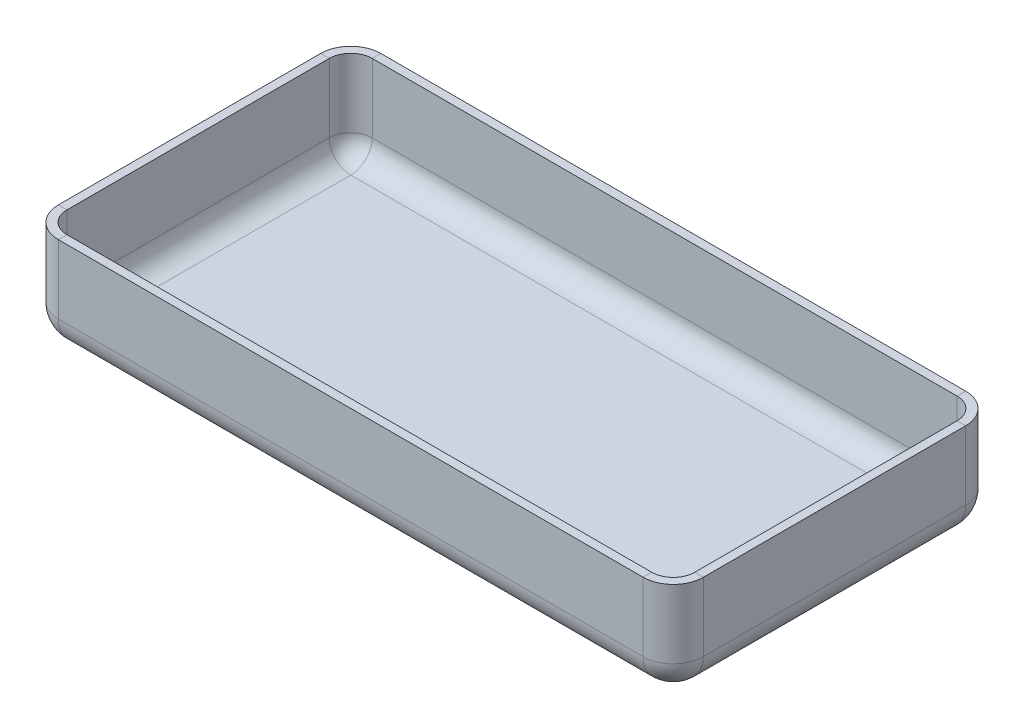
ISO-10303-21;
HEADER;
FILE_DESCRIPTION(('STEP AP214'),'2;1');
FILE_NAME('part.step','',(''),(''),'','','');
FILE_SCHEMA(('AUTOMOTIVE_DESIGN { 1 0 10303 214 1 1 1 1 }'));
ENDSEC;
DATA;
#1=APPLICATION_CONTEXT('core data for automotive mechanical design processes');
#2=APPLICATION_PROTOCOL_DEFINITION('international standard','automotive_design',2000,#1);
#3=PRODUCT_CONTEXT('',#1,'mechanical');
#4=PRODUCT('Part','Part','',(#3));
#5=PRODUCT_RELATED_PRODUCT_CATEGORY('part','',(#4));
#6=PRODUCT_DEFINITION_FORMATION('','',#4);
#7=PRODUCT_DEFINITION_CONTEXT('part definition',#1,'design');
#8=PRODUCT_DEFINITION('design','',#6,#7);
#9=PRODUCT_DEFINITION_SHAPE('','',#8);
#10=(LENGTH_UNIT() NAMED_UNIT(*) SI_UNIT(.MILLI.,.METRE.));
#11=(NAMED_UNIT(*) PLANE_ANGLE_UNIT() SI_UNIT($,.RADIAN.));
#12=(NAMED_UNIT(*) SI_UNIT($,.STERADIAN.) SOLID_ANGLE_UNIT());
#13=UNCERTAINTY_MEASURE_WITH_UNIT(LENGTH_MEASURE(1.E-05),#10,'distance_accuracy_value','');
#14=(GEOMETRIC_REPRESENTATION_CONTEXT(3) GLOBAL_UNCERTAINTY_ASSIGNED_CONTEXT((#13)) GLOBAL_UNIT_ASSIGNED_CONTEXT((#10,
#11,#12)) REPRESENTATION_CONTEXT('',''));
#15=CARTESIAN_POINT('',(0.,0.,0.));
#16=DIRECTION('',(0.,0.,1.));
#17=DIRECTION('',(1.,0.,0.));
#18=AXIS2_PLACEMENT_3D('',#15,#16,#17);
#19=CARTESIAN_POINT('',(0.,30.,0.));
#20=DIRECTION('',(1.,0.,0.));
#21=DIRECTION('',(0.,0.,-1.));
#22=AXIS2_PLACEMENT_3D('',#19,#20,#21);
#23=PLANE('',#22);
#24=DIRECTION('',(0.,-1.,0.));
#25=VECTOR('',#24,1.);
#26=CARTESIAN_POINT('',(0.,30.,-7.));
#27=LINE('',#26,#25);
#28=CARTESIAN_POINT('',(0.,7.,-7.));
#29=VERTEX_POINT('',#28);
#30=CARTESIAN_POINT('',(0.,23.,-7.));
#31=VERTEX_POINT('',#30);
#32=EDGE_CURVE('E226',#29,#31,#27,.F.);
#33=ORIENTED_EDGE('',*,*,#32,.T.);
#34=DIRECTION('',(0.,0.,1.));
#35=VECTOR('',#34,1.);
#36=CARTESIAN_POINT('',(0.,23.,0.));
#37=LINE('',#36,#35);
#38=CARTESIAN_POINT('',(0.,23.,-68.));
#39=VERTEX_POINT('',#38);
#40=EDGE_CURVE('E229',#31,#39,#37,.F.);
#41=ORIENTED_EDGE('',*,*,#40,.T.);
#42=DIRECTION('',(0.,-1.,0.));
#43=VECTOR('',#42,1.);
#44=CARTESIAN_POINT('',(0.,30.,-68.));
#45=LINE('',#44,#43);
#46=CARTESIAN_POINT('',(0.,7.,-68.));
#47=VERTEX_POINT('',#46);
#48=EDGE_CURVE('E224',#39,#47,#45,.T.);
#49=ORIENTED_EDGE('',*,*,#48,.T.);
#50=DIRECTION('',(0.,0.,1.));
#51=VECTOR('',#50,1.);
#52=CARTESIAN_POINT('',(0.,7.,0.));
#53=LINE('',#52,#51);
#54=EDGE_CURVE('E222',#47,#29,#53,.T.);
#55=ORIENTED_EDGE('',*,*,#54,.T.);
#56=EDGE_LOOP('',(#33,#41,#49,#55));
#57=FACE_BOUND('',#56,.T.);
#58=ADVANCED_FACE('F33',(#57),#23,.F.);
#59=CARTESIAN_POINT('',(0.,30.,0.));
#60=DIRECTION('',(0.,0.,-1.));
#61=DIRECTION('',(-1.,0.,0.));
#62=AXIS2_PLACEMENT_3D('',#59,#60,#61);
#63=PLANE('',#62);
#64=DIRECTION('',(0.,-1.,0.));
#65=VECTOR('',#64,1.);
#66=CARTESIAN_POINT('',(143.,30.,0.));
#67=LINE('',#66,#65);
#68=CARTESIAN_POINT('',(143.,7.,0.));
#69=VERTEX_POINT('',#68);
#70=CARTESIAN_POINT('',(143.,23.,0.));
#71=VERTEX_POINT('',#70);
#72=EDGE_CURVE('E208',#69,#71,#67,.F.);
#73=ORIENTED_EDGE('',*,*,#72,.T.);
#74=DIRECTION('',(1.,0.,0.));
#75=VECTOR('',#74,1.);
#76=CARTESIAN_POINT('',(0.,23.,0.));
#77=LINE('',#76,#75);
#78=CARTESIAN_POINT('',(7.,23.,0.));
#79=VERTEX_POINT('',#78);
#80=EDGE_CURVE('E219',#71,#79,#77,.F.);
#81=ORIENTED_EDGE('',*,*,#80,.T.);
#82=DIRECTION('',(0.,-1.,0.));
#83=VECTOR('',#82,1.);
#84=CARTESIAN_POINT('',(7.,30.,0.));
#85=LINE('',#84,#83);
#86=CARTESIAN_POINT('',(7.,7.,0.));
#87=VERTEX_POINT('',#86);
#88=EDGE_CURVE('E216',#79,#87,#85,.T.);
#89=ORIENTED_EDGE('',*,*,#88,.T.);
#90=DIRECTION('',(1.,0.,0.));
#91=VECTOR('',#90,1.);
#92=CARTESIAN_POINT('',(150.,7.,0.));
#93=LINE('',#92,#91);
#94=EDGE_CURVE('E205',#87,#69,#93,.T.);
#95=ORIENTED_EDGE('',*,*,#94,.T.);
#96=EDGE_LOOP('',(#73,#81,#89,#95));
#97=FACE_BOUND('',#96,.T.);
#98=ADVANCED_FACE('F333',(#97),#63,.F.);
#99=CARTESIAN_POINT('',(150.,30.,0.));
#100=DIRECTION('',(-1.,0.,0.));
#101=DIRECTION('',(0.,0.,1.));
#102=AXIS2_PLACEMENT_3D('',#99,#100,#101);
#103=PLANE('',#102);
#104=DIRECTION('',(0.,-1.,0.));
#105=VECTOR('',#104,1.);
#106=CARTESIAN_POINT('',(150.,30.,-68.));
#107=LINE('',#106,#105);
#108=CARTESIAN_POINT('',(150.,7.,-68.));
#109=VERTEX_POINT('',#108);
#110=CARTESIAN_POINT('',(150.,23.,-68.));
#111=VERTEX_POINT('',#110);
#112=EDGE_CURVE('E193',#109,#111,#107,.F.);
#113=ORIENTED_EDGE('',*,*,#112,.T.);
#114=DIRECTION('',(0.,0.,-1.));
#115=VECTOR('',#114,1.);
#116=CARTESIAN_POINT('',(150.,23.,0.));
#117=LINE('',#116,#115);
#118=CARTESIAN_POINT('',(150.,23.,-7.));
#119=VERTEX_POINT('',#118);
#120=EDGE_CURVE('E167',#111,#119,#117,.F.);
#121=ORIENTED_EDGE('',*,*,#120,.T.);
#122=DIRECTION('',(0.,-1.,0.));
#123=VECTOR('',#122,1.);
#124=CARTESIAN_POINT('',(150.,30.,-7.));
#125=LINE('',#124,#123);
#126=CARTESIAN_POINT('',(150.,7.,-7.));
#127=VERTEX_POINT('',#126);
#128=EDGE_CURVE('E179',#119,#127,#125,.T.);
#129=ORIENTED_EDGE('',*,*,#128,.T.);
#130=DIRECTION('',(0.,0.,-1.));
#131=VECTOR('',#130,1.);
#132=CARTESIAN_POINT('',(150.,7.,-75.));
#133=LINE('',#132,#131);
#134=EDGE_CURVE('E196',#127,#109,#133,.T.);
#135=ORIENTED_EDGE('',*,*,#134,.T.);
#136=EDGE_LOOP('',(#113,#121,#129,#135));
#137=FACE_BOUND('',#136,.T.);
#138=ADVANCED_FACE('F194',(#137),#103,.F.);
#139=CARTESIAN_POINT('',(0.,30.,-75.));
#140=DIRECTION('',(0.,0.,1.));
#141=DIRECTION('',(1.,0.,0.));
#142=AXIS2_PLACEMENT_3D('',#139,#140,#141);
#143=PLANE('',#142);
#144=DIRECTION('',(0.,-1.,0.));
#145=VECTOR('',#144,1.);
#146=CARTESIAN_POINT('',(7.,30.,-75.));
#147=LINE('',#146,#145);
#148=CARTESIAN_POINT('',(7.,7.,-75.));
#149=VERTEX_POINT('',#148);
#150=CARTESIAN_POINT('',(7.,23.,-75.));
#151=VERTEX_POINT('',#150);
#152=EDGE_CURVE('E235',#149,#151,#147,.F.);
#153=ORIENTED_EDGE('',*,*,#152,.T.);
#154=DIRECTION('',(-1.,0.,0.));
#155=VECTOR('',#154,1.);
#156=CARTESIAN_POINT('',(0.,23.,-75.));
#157=LINE('',#156,#155);
#158=CARTESIAN_POINT('',(143.,23.,-75.));
#159=VERTEX_POINT('',#158);
#160=EDGE_CURVE('E239',#151,#159,#157,.F.);
#161=ORIENTED_EDGE('',*,*,#160,.T.);
#162=DIRECTION('',(0.,-1.,0.));
#163=VECTOR('',#162,1.);
#164=CARTESIAN_POINT('',(143.,30.,-75.));
#165=LINE('',#164,#163);
#166=CARTESIAN_POINT('',(143.,7.,-75.));
#167=VERTEX_POINT('',#166);
#168=EDGE_CURVE('E204',#159,#167,#165,.T.);
#169=ORIENTED_EDGE('',*,*,#168,.T.);
#170=DIRECTION('',(-1.,0.,0.));
#171=VECTOR('',#170,1.);
#172=CARTESIAN_POINT('',(0.,7.,-75.));
#173=LINE('',#172,#171);
#174=EDGE_CURVE('E178',#167,#149,#173,.T.);
#175=ORIENTED_EDGE('',*,*,#174,.T.);
#176=EDGE_LOOP('',(#153,#161,#169,#175));
#177=FACE_BOUND('',#176,.T.);
#178=ADVANCED_FACE('F294',(#177),#143,.F.);
#179=CARTESIAN_POINT('',(0.,0.,-75.));
#180=DIRECTION('',(0.,-1.,0.));
#181=DIRECTION('',(0.,0.,-1.));
#182=AXIS2_PLACEMENT_3D('',#179,#180,#181);
#183=PLANE('',#182);
#184=DIRECTION('',(0.,0.,-1.));
#185=VECTOR('',#184,1.);
#186=CARTESIAN_POINT('',(143.,0.,0.));
#187=LINE('',#186,#185);
#188=CARTESIAN_POINT('',(143.,0.,-68.));
#189=VERTEX_POINT('',#188);
#190=CARTESIAN_POINT('',(143.,0.,-7.));
#191=VERTEX_POINT('',#190);
#192=EDGE_CURVE('E40',#189,#191,#187,.F.);
#193=ORIENTED_EDGE('',*,*,#192,.T.);
#194=DIRECTION('',(1.,0.,0.));
#195=VECTOR('',#194,1.);
#196=CARTESIAN_POINT('',(0.,0.,-7.));
#197=LINE('',#196,#195);
#198=CARTESIAN_POINT('',(7.,0.,-7.));
#199=VERTEX_POINT('',#198);
#200=EDGE_CURVE('E11',#191,#199,#197,.F.);
#201=ORIENTED_EDGE('',*,*,#200,.T.);
#202=DIRECTION('',(0.,0.,1.));
#203=VECTOR('',#202,1.);
#204=CARTESIAN_POINT('',(7.,0.,-75.));
#205=LINE('',#204,#203);
#206=CARTESIAN_POINT('',(7.,0.,-68.));
#207=VERTEX_POINT('',#206);
#208=EDGE_CURVE('E242',#199,#207,#205,.F.);
#209=ORIENTED_EDGE('',*,*,#208,.T.);
#210=DIRECTION('',(-1.,0.,0.));
#211=VECTOR('',#210,1.);
#212=CARTESIAN_POINT('',(150.,0.,-68.));
#213=LINE('',#212,#211);
#214=EDGE_CURVE('E50',#207,#189,#213,.F.);
#215=ORIENTED_EDGE('',*,*,#214,.T.);
#216=EDGE_LOOP('',(#193,#201,#209,#215));
#217=FACE_BOUND('',#216,.T.);
#218=ADVANCED_FACE('F245',(#217),#183,.T.);
#219=CARTESIAN_POINT('',(143.,30.,-68.));
#220=DIRECTION('',(0.,-1.,0.));
#221=DIRECTION('',(0.,0.,-1.));
#222=AXIS2_PLACEMENT_3D('',#219,#220,#221);
#223=CYLINDRICAL_SURFACE('',#222,7.);
#224=CARTESIAN_POINT('',(143.,23.,-68.));
#225=DIRECTION('',(0.,1.,0.));
#226=DIRECTION('',(0.,0.,1.));
#227=AXIS2_PLACEMENT_3D('',#224,#225,#226);
#228=CIRCLE('',#227,7.);
#229=EDGE_CURVE('E185',#111,#159,#228,.T.);
#230=ORIENTED_EDGE('',*,*,#229,.F.);
#231=ORIENTED_EDGE('',*,*,#112,.F.);
#232=CARTESIAN_POINT('',(143.,7.,-68.));
#233=DIRECTION('',(0.,-1.,0.));
#234=DIRECTION('',(0.,0.,-1.));
#235=AXIS2_PLACEMENT_3D('',#232,#233,#234);
#236=CIRCLE('',#235,7.);
#237=EDGE_CURVE('E206',#167,#109,#236,.T.);
#238=ORIENTED_EDGE('',*,*,#237,.F.);
#239=ORIENTED_EDGE('',*,*,#168,.F.);
#240=EDGE_LOOP('',(#230,#231,#238,#239));
#241=FACE_BOUND('',#240,.T.);
#242=ADVANCED_FACE('F202',(#241),#223,.T.);
#243=CARTESIAN_POINT('',(143.,7.,-68.));
#244=DIRECTION('',(0.,0.,1.));
#245=DIRECTION('',(1.,0.,0.));
#246=AXIS2_PLACEMENT_3D('',#243,#244,#245);
#247=SPHERICAL_SURFACE('',#246,7.);
#248=CARTESIAN_POINT('',(143.,7.,-68.));
#249=DIRECTION('',(1.,0.,0.));
#250=DIRECTION('',(0.,0.,-1.));
#251=AXIS2_PLACEMENT_3D('',#248,#249,#250);
#252=CIRCLE('',#251,7.);
#253=EDGE_CURVE('E257',#167,#189,#252,.F.);
#254=ORIENTED_EDGE('',*,*,#253,.F.);
#255=ORIENTED_EDGE('',*,*,#237,.T.);
#256=CARTESIAN_POINT('',(143.,7.,-68.));
#257=DIRECTION('',(0.,0.,-1.));
#258=DIRECTION('',(-1.,0.,0.));
#259=AXIS2_PLACEMENT_3D('',#256,#257,#258);
#260=CIRCLE('',#259,7.);
#261=EDGE_CURVE('E210',#189,#109,#260,.F.);
#262=ORIENTED_EDGE('',*,*,#261,.F.);
#263=EDGE_LOOP('',(#254,#255,#262));
#264=FACE_BOUND('',#263,.T.);
#265=ADVANCED_FACE('F292',(#264),#247,.T.);
#266=CARTESIAN_POINT('',(143.,30.,-7.));
#267=DIRECTION('',(0.,-1.,0.));
#268=DIRECTION('',(0.,0.,-1.));
#269=AXIS2_PLACEMENT_3D('',#266,#267,#268);
#270=CYLINDRICAL_SURFACE('',#269,7.);
#271=CARTESIAN_POINT('',(143.,7.,-7.));
#272=DIRECTION('',(0.,-1.,0.));
#273=DIRECTION('',(0.,0.,-1.));
#274=AXIS2_PLACEMENT_3D('',#271,#272,#273);
#275=CIRCLE('',#274,7.);
#276=EDGE_CURVE('E281',#127,#69,#275,.T.);
#277=ORIENTED_EDGE('',*,*,#276,.F.);
#278=ORIENTED_EDGE('',*,*,#128,.F.);
#279=CARTESIAN_POINT('',(143.,23.,-7.));
#280=DIRECTION('',(0.,1.,0.));
#281=DIRECTION('',(0.,0.,1.));
#282=AXIS2_PLACEMENT_3D('',#279,#280,#281);
#283=CIRCLE('',#282,7.);
#284=EDGE_CURVE('E284',#71,#119,#283,.T.);
#285=ORIENTED_EDGE('',*,*,#284,.F.);
#286=ORIENTED_EDGE('',*,*,#72,.F.);
#287=EDGE_LOOP('',(#277,#278,#285,#286));
#288=FACE_BOUND('',#287,.T.);
#289=ADVANCED_FACE('F368',(#288),#270,.T.);
#290=CARTESIAN_POINT('',(143.,7.,0.));
#291=DIRECTION('',(0.,0.,1.));
#292=DIRECTION('',(1.,0.,0.));
#293=AXIS2_PLACEMENT_3D('',#290,#291,#292);
#294=CYLINDRICAL_SURFACE('',#293,7.);
#295=ORIENTED_EDGE('',*,*,#261,.T.);
#296=ORIENTED_EDGE('',*,*,#134,.F.);
#297=CARTESIAN_POINT('',(143.,7.,-7.));
#298=DIRECTION('',(0.,0.,1.));
#299=DIRECTION('',(1.,0.,0.));
#300=AXIS2_PLACEMENT_3D('',#297,#298,#299);
#301=CIRCLE('',#300,7.);
#302=EDGE_CURVE('E266',#191,#127,#301,.T.);
#303=ORIENTED_EDGE('',*,*,#302,.F.);
#304=ORIENTED_EDGE('',*,*,#192,.F.);
#305=EDGE_LOOP('',(#295,#296,#303,#304));
#306=FACE_BOUND('',#305,.T.);
#307=ADVANCED_FACE('F290',(#306),#294,.T.);
#308=CARTESIAN_POINT('',(0.,7.,-68.));
#309=DIRECTION('',(1.,0.,0.));
#310=DIRECTION('',(0.,0.,-1.));
#311=AXIS2_PLACEMENT_3D('',#308,#309,#310);
#312=CYLINDRICAL_SURFACE('',#311,7.);
#313=ORIENTED_EDGE('',*,*,#253,.T.);
#314=ORIENTED_EDGE('',*,*,#214,.F.);
#315=CARTESIAN_POINT('',(7.,7.,-68.));
#316=DIRECTION('',(-1.,0.,0.));
#317=DIRECTION('',(0.,0.,1.));
#318=AXIS2_PLACEMENT_3D('',#315,#316,#317);
#319=CIRCLE('',#318,7.);
#320=EDGE_CURVE('E254',#149,#207,#319,.T.);
#321=ORIENTED_EDGE('',*,*,#320,.F.);
#322=ORIENTED_EDGE('',*,*,#174,.F.);
#323=EDGE_LOOP('',(#313,#314,#321,#322));
#324=FACE_BOUND('',#323,.T.);
#325=ADVANCED_FACE('F253',(#324),#312,.T.);
#326=CARTESIAN_POINT('',(7.,30.,-68.));
#327=DIRECTION('',(0.,-1.,0.));
#328=DIRECTION('',(0.,0.,-1.));
#329=AXIS2_PLACEMENT_3D('',#326,#327,#328);
#330=CYLINDRICAL_SURFACE('',#329,7.);
#331=CARTESIAN_POINT('',(7.,23.,-68.));
#332=DIRECTION('',(0.,1.,0.));
#333=DIRECTION('',(0.,0.,1.));
#334=AXIS2_PLACEMENT_3D('',#331,#332,#333);
#335=CIRCLE('',#334,7.);
#336=EDGE_CURVE('E286',#151,#39,#335,.T.);
#337=ORIENTED_EDGE('',*,*,#336,.F.);
#338=ORIENTED_EDGE('',*,*,#152,.F.);
#339=CARTESIAN_POINT('',(7.,7.,-68.));
#340=DIRECTION('',(0.,-1.,0.));
#341=DIRECTION('',(0.,0.,-1.));
#342=AXIS2_PLACEMENT_3D('',#339,#340,#341);
#343=CIRCLE('',#342,7.);
#344=EDGE_CURVE('E265',#47,#149,#343,.T.);
#345=ORIENTED_EDGE('',*,*,#344,.F.);
#346=ORIENTED_EDGE('',*,*,#48,.F.);
#347=EDGE_LOOP('',(#337,#338,#345,#346));
#348=FACE_BOUND('',#347,.T.);
#349=ADVANCED_FACE('F340',(#348),#330,.T.);
#350=CARTESIAN_POINT('',(143.,7.,-7.));
#351=DIRECTION('',(0.,0.,1.));
#352=DIRECTION('',(1.,0.,0.));
#353=AXIS2_PLACEMENT_3D('',#350,#351,#352);
#354=SPHERICAL_SURFACE('',#353,7.);
#355=ORIENTED_EDGE('',*,*,#302,.T.);
#356=ORIENTED_EDGE('',*,*,#276,.T.);
#357=CARTESIAN_POINT('',(143.,7.,-7.));
#358=DIRECTION('',(1.,0.,0.));
#359=DIRECTION('',(0.,0.,-1.));
#360=AXIS2_PLACEMENT_3D('',#357,#358,#359);
#361=CIRCLE('',#360,7.);
#362=EDGE_CURVE('E269',#191,#69,#361,.F.);
#363=ORIENTED_EDGE('',*,*,#362,.F.);
#364=EDGE_LOOP('',(#355,#356,#363));
#365=FACE_BOUND('',#364,.T.);
#366=ADVANCED_FACE('F342',(#365),#354,.T.);
#367=CARTESIAN_POINT('',(7.,7.,-68.));
#368=DIRECTION('',(0.,0.,1.));
#369=DIRECTION('',(1.,0.,0.));
#370=AXIS2_PLACEMENT_3D('',#367,#368,#369);
#371=SPHERICAL_SURFACE('',#370,7.);
#372=ORIENTED_EDGE('',*,*,#344,.T.);
#373=ORIENTED_EDGE('',*,*,#320,.T.);
#374=CARTESIAN_POINT('',(7.,7.,-68.));
#375=DIRECTION('',(0.,0.,-1.));
#376=DIRECTION('',(-1.,0.,0.));
#377=AXIS2_PLACEMENT_3D('',#374,#375,#376);
#378=CIRCLE('',#377,7.);
#379=EDGE_CURVE('E262',#47,#207,#378,.F.);
#380=ORIENTED_EDGE('',*,*,#379,.F.);
#381=EDGE_LOOP('',(#372,#373,#380));
#382=FACE_BOUND('',#381,.T.);
#383=ADVANCED_FACE('F261',(#382),#371,.T.);
#384=CARTESIAN_POINT('',(0.,7.,-7.));
#385=DIRECTION('',(-1.,0.,0.));
#386=DIRECTION('',(0.,0.,1.));
#387=AXIS2_PLACEMENT_3D('',#384,#385,#386);
#388=CYLINDRICAL_SURFACE('',#387,7.);
#389=ORIENTED_EDGE('',*,*,#362,.T.);
#390=ORIENTED_EDGE('',*,*,#94,.F.);
#391=CARTESIAN_POINT('',(7.,7.,-7.));
#392=DIRECTION('',(-1.,0.,0.));
#393=DIRECTION('',(0.,0.,1.));
#394=AXIS2_PLACEMENT_3D('',#391,#392,#393);
#395=CIRCLE('',#394,7.);
#396=EDGE_CURVE('E270',#199,#87,#395,.T.);
#397=ORIENTED_EDGE('',*,*,#396,.F.);
#398=ORIENTED_EDGE('',*,*,#200,.F.);
#399=EDGE_LOOP('',(#389,#390,#397,#398));
#400=FACE_BOUND('',#399,.T.);
#401=ADVANCED_FACE('F328',(#400),#388,.T.);
#402=CARTESIAN_POINT('',(7.,7.,0.));
#403=DIRECTION('',(0.,0.,-1.));
#404=DIRECTION('',(-1.,0.,0.));
#405=AXIS2_PLACEMENT_3D('',#402,#403,#404);
#406=CYLINDRICAL_SURFACE('',#405,7.);
#407=ORIENTED_EDGE('',*,*,#379,.T.);
#408=ORIENTED_EDGE('',*,*,#208,.F.);
#409=CARTESIAN_POINT('',(7.,7.,-7.));
#410=DIRECTION('',(0.,0.,1.));
#411=DIRECTION('',(1.,0.,0.));
#412=AXIS2_PLACEMENT_3D('',#409,#410,#411);
#413=CIRCLE('',#412,7.);
#414=EDGE_CURVE('E275',#29,#199,#413,.T.);
#415=ORIENTED_EDGE('',*,*,#414,.F.);
#416=ORIENTED_EDGE('',*,*,#54,.F.);
#417=EDGE_LOOP('',(#407,#408,#415,#416));
#418=FACE_BOUND('',#417,.T.);
#419=ADVANCED_FACE('F268',(#418),#406,.T.);
#420=CARTESIAN_POINT('',(7.,7.,-7.));
#421=DIRECTION('',(0.,0.,1.));
#422=DIRECTION('',(1.,0.,0.));
#423=AXIS2_PLACEMENT_3D('',#420,#421,#422);
#424=SPHERICAL_SURFACE('',#423,7.);
#425=ORIENTED_EDGE('',*,*,#414,.T.);
#426=ORIENTED_EDGE('',*,*,#396,.T.);
#427=CARTESIAN_POINT('',(7.,7.,-7.));
#428=DIRECTION('',(0.,-1.,0.));
#429=DIRECTION('',(0.,0.,-1.));
#430=AXIS2_PLACEMENT_3D('',#427,#428,#429);
#431=CIRCLE('',#430,7.);
#432=EDGE_CURVE('E316',#29,#87,#431,.F.);
#433=ORIENTED_EDGE('',*,*,#432,.F.);
#434=EDGE_LOOP('',(#425,#426,#433));
#435=FACE_BOUND('',#434,.T.);
#436=ADVANCED_FACE('F324',(#435),#424,.T.);
#437=CARTESIAN_POINT('',(7.,30.,-7.));
#438=DIRECTION('',(0.,-1.,0.));
#439=DIRECTION('',(0.,0.,-1.));
#440=AXIS2_PLACEMENT_3D('',#437,#438,#439);
#441=CYLINDRICAL_SURFACE('',#440,7.);
#442=CARTESIAN_POINT('',(7.,23.,-7.));
#443=DIRECTION('',(0.,1.,0.));
#444=DIRECTION('',(0.,0.,1.));
#445=AXIS2_PLACEMENT_3D('',#442,#443,#444);
#446=CIRCLE('',#445,7.);
#447=EDGE_CURVE('E318',#79,#31,#446,.F.);
#448=ORIENTED_EDGE('',*,*,#447,.T.);
#449=ORIENTED_EDGE('',*,*,#32,.F.);
#450=ORIENTED_EDGE('',*,*,#432,.T.);
#451=ORIENTED_EDGE('',*,*,#88,.F.);
#452=EDGE_LOOP('',(#448,#449,#450,#451));
#453=FACE_BOUND('',#452,.T.);
#454=ADVANCED_FACE('F335',(#453),#441,.T.);
#455=CARTESIAN_POINT('',(7.,23.,-7.));
#456=DIRECTION('',(0.,-1.,0.));
#457=DIRECTION('',(0.,0.,-1.));
#458=AXIS2_PLACEMENT_3D('',#455,#456,#457);
#459=PLANE('',#458);
#460=ORIENTED_EDGE('',*,*,#447,.F.);
#461=DIRECTION('',(0.,0.,1.));
#462=VECTOR('',#461,1.);
#463=CARTESIAN_POINT('',(7.,23.,0.));
#464=LINE('',#463,#462);
#465=CARTESIAN_POINT('',(7.,23.,-2.));
#466=VERTEX_POINT('',#465);
#467=EDGE_CURVE('E724',#466,#79,#464,.T.);
#468=ORIENTED_EDGE('',*,*,#467,.F.);
#469=CARTESIAN_POINT('',(7.,23.,-7.));
#470=DIRECTION('',(0.,-1.,0.));
#471=DIRECTION('',(0.,0.,-1.));
#472=AXIS2_PLACEMENT_3D('',#469,#470,#471);
#473=CIRCLE('',#472,5.);
#474=CARTESIAN_POINT('',(2.,23.,-7.));
#475=VERTEX_POINT('',#474);
#476=EDGE_CURVE('E190',#466,#475,#473,.T.);
#477=ORIENTED_EDGE('',*,*,#476,.T.);
#478=DIRECTION('',(1.,0.,0.));
#479=VECTOR('',#478,1.);
#480=CARTESIAN_POINT('',(0.,23.,-7.));
#481=LINE('',#480,#479);
#482=EDGE_CURVE('E319',#475,#31,#481,.F.);
#483=ORIENTED_EDGE('',*,*,#482,.T.);
#484=EDGE_LOOP('',(#460,#468,#477,#483));
#485=FACE_BOUND('',#484,.T.);
#486=ADVANCED_FACE('F465',(#485),#459,.F.);
#487=CARTESIAN_POINT('',(75.,23.,0.));
#488=DIRECTION('',(0.,-1.,0.));
#489=DIRECTION('',(1.,0.,0.));
#490=AXIS2_PLACEMENT_3D('',#487,#488,#489);
#491=PLANE('',#490);
#492=ORIENTED_EDGE('',*,*,#80,.F.);
#493=DIRECTION('',(0.,0.,-1.));
#494=VECTOR('',#493,1.);
#495=CARTESIAN_POINT('',(143.,23.,0.));
#496=LINE('',#495,#494);
#497=CARTESIAN_POINT('',(143.,23.,-2.));
#498=VERTEX_POINT('',#497);
#499=EDGE_CURVE('E309',#498,#71,#496,.F.);
#500=ORIENTED_EDGE('',*,*,#499,.F.);
#501=DIRECTION('',(-1.,0.,0.));
#502=VECTOR('',#501,1.);
#503=CARTESIAN_POINT('',(0.,23.,-2.));
#504=LINE('',#503,#502);
#505=EDGE_CURVE('E720',#498,#466,#504,.T.);
#506=ORIENTED_EDGE('',*,*,#505,.T.);
#507=ORIENTED_EDGE('',*,*,#467,.T.);
#508=EDGE_LOOP('',(#492,#500,#506,#507));
#509=FACE_BOUND('',#508,.T.);
#510=ADVANCED_FACE('F475',(#509),#491,.F.);
#511=CARTESIAN_POINT('',(0.,23.,-37.5));
#512=DIRECTION('',(0.,-1.,0.));
#513=DIRECTION('',(0.,0.,1.));
#514=AXIS2_PLACEMENT_3D('',#511,#512,#513);
#515=PLANE('',#514);
#516=ORIENTED_EDGE('',*,*,#40,.F.);
#517=ORIENTED_EDGE('',*,*,#482,.F.);
#518=DIRECTION('',(0.,0.,-1.));
#519=VECTOR('',#518,1.);
#520=CARTESIAN_POINT('',(2.,23.,0.));
#521=LINE('',#520,#519);
#522=CARTESIAN_POINT('',(2.,23.,-68.));
#523=VERTEX_POINT('',#522);
#524=EDGE_CURVE('E727',#475,#523,#521,.T.);
#525=ORIENTED_EDGE('',*,*,#524,.T.);
#526=DIRECTION('',(-1.,0.,0.));
#527=VECTOR('',#526,1.);
#528=CARTESIAN_POINT('',(0.,23.,-68.));
#529=LINE('',#528,#527);
#530=EDGE_CURVE('E312',#523,#39,#529,.T.);
#531=ORIENTED_EDGE('',*,*,#530,.T.);
#532=EDGE_LOOP('',(#516,#517,#525,#531));
#533=FACE_BOUND('',#532,.T.);
#534=ADVANCED_FACE('F486',(#533),#515,.F.);
#535=CARTESIAN_POINT('',(143.,23.,-7.));
#536=DIRECTION('',(0.,-1.,0.));
#537=DIRECTION('',(0.,0.,-1.));
#538=AXIS2_PLACEMENT_3D('',#535,#536,#537);
#539=PLANE('',#538);
#540=ORIENTED_EDGE('',*,*,#284,.T.);
#541=DIRECTION('',(1.,0.,0.));
#542=VECTOR('',#541,1.);
#543=CARTESIAN_POINT('',(150.,23.,-7.));
#544=LINE('',#543,#542);
#545=CARTESIAN_POINT('',(148.,23.,-7.));
#546=VERTEX_POINT('',#545);
#547=EDGE_CURVE('E173',#546,#119,#544,.T.);
#548=ORIENTED_EDGE('',*,*,#547,.F.);
#549=CARTESIAN_POINT('',(143.,23.,-7.));
#550=DIRECTION('',(0.,-1.,0.));
#551=DIRECTION('',(0.,0.,-1.));
#552=AXIS2_PLACEMENT_3D('',#549,#550,#551);
#553=CIRCLE('',#552,5.);
#554=EDGE_CURVE('E760',#498,#546,#553,.F.);
#555=ORIENTED_EDGE('',*,*,#554,.F.);
#556=ORIENTED_EDGE('',*,*,#499,.T.);
#557=EDGE_LOOP('',(#540,#548,#555,#556));
#558=FACE_BOUND('',#557,.T.);
#559=ADVANCED_FACE('F496',(#558),#539,.F.);
#560=CARTESIAN_POINT('',(7.,23.,-68.));
#561=DIRECTION('',(0.,-1.,0.));
#562=DIRECTION('',(0.,0.,-1.));
#563=AXIS2_PLACEMENT_3D('',#560,#561,#562);
#564=PLANE('',#563);
#565=ORIENTED_EDGE('',*,*,#336,.T.);
#566=ORIENTED_EDGE('',*,*,#530,.F.);
#567=CARTESIAN_POINT('',(7.,23.,-68.));
#568=DIRECTION('',(0.,-1.,0.));
#569=DIRECTION('',(0.,0.,-1.));
#570=AXIS2_PLACEMENT_3D('',#567,#568,#569);
#571=CIRCLE('',#570,5.);
#572=CARTESIAN_POINT('',(7.,23.,-73.));
#573=VERTEX_POINT('',#572);
#574=EDGE_CURVE('E308',#573,#523,#571,.F.);
#575=ORIENTED_EDGE('',*,*,#574,.F.);
#576=DIRECTION('',(0.,0.,1.));
#577=VECTOR('',#576,1.);
#578=CARTESIAN_POINT('',(7.,23.,-75.));
#579=LINE('',#578,#577);
#580=EDGE_CURVE('E301',#573,#151,#579,.F.);
#581=ORIENTED_EDGE('',*,*,#580,.T.);
#582=EDGE_LOOP('',(#565,#566,#575,#581));
#583=FACE_BOUND('',#582,.T.);
#584=ADVANCED_FACE('F305',(#583),#564,.F.);
#585=CARTESIAN_POINT('',(150.,23.,-37.5));
#586=DIRECTION('',(0.,-1.,0.));
#587=DIRECTION('',(0.,0.,-1.));
#588=AXIS2_PLACEMENT_3D('',#585,#586,#587);
#589=PLANE('',#588);
#590=ORIENTED_EDGE('',*,*,#120,.F.);
#591=DIRECTION('',(-1.,0.,0.));
#592=VECTOR('',#591,1.);
#593=CARTESIAN_POINT('',(150.,23.,-68.));
#594=LINE('',#593,#592);
#595=CARTESIAN_POINT('',(148.,23.,-68.));
#596=VERTEX_POINT('',#595);
#597=EDGE_CURVE('E171',#596,#111,#594,.F.);
#598=ORIENTED_EDGE('',*,*,#597,.F.);
#599=DIRECTION('',(0.,0.,1.));
#600=VECTOR('',#599,1.);
#601=CARTESIAN_POINT('',(148.,23.,0.));
#602=LINE('',#601,#600);
#603=EDGE_CURVE('E764',#596,#546,#602,.T.);
#604=ORIENTED_EDGE('',*,*,#603,.T.);
#605=ORIENTED_EDGE('',*,*,#547,.T.);
#606=EDGE_LOOP('',(#590,#598,#604,#605));
#607=FACE_BOUND('',#606,.T.);
#608=ADVANCED_FACE('F169',(#607),#589,.F.);
#609=CARTESIAN_POINT('',(75.,23.,-75.));
#610=DIRECTION('',(0.,-1.,0.));
#611=DIRECTION('',(-1.,0.,0.));
#612=AXIS2_PLACEMENT_3D('',#609,#610,#611);
#613=PLANE('',#612);
#614=ORIENTED_EDGE('',*,*,#160,.F.);
#615=ORIENTED_EDGE('',*,*,#580,.F.);
#616=DIRECTION('',(1.,0.,0.));
#617=VECTOR('',#616,1.);
#618=CARTESIAN_POINT('',(0.,23.,-73.));
#619=LINE('',#618,#617);
#620=CARTESIAN_POINT('',(143.,23.,-73.));
#621=VERTEX_POINT('',#620);
#622=EDGE_CURVE('E766',#573,#621,#619,.T.);
#623=ORIENTED_EDGE('',*,*,#622,.T.);
#624=DIRECTION('',(0.,0.,-1.));
#625=VECTOR('',#624,1.);
#626=CARTESIAN_POINT('',(143.,23.,-75.));
#627=LINE('',#626,#625);
#628=EDGE_CURVE('E189',#621,#159,#627,.T.);
#629=ORIENTED_EDGE('',*,*,#628,.T.);
#630=EDGE_LOOP('',(#614,#615,#623,#629));
#631=FACE_BOUND('',#630,.T.);
#632=ADVANCED_FACE('F299',(#631),#613,.F.);
#633=CARTESIAN_POINT('',(143.,23.,-68.));
#634=DIRECTION('',(0.,-1.,0.));
#635=DIRECTION('',(0.,0.,-1.));
#636=AXIS2_PLACEMENT_3D('',#633,#634,#635);
#637=PLANE('',#636);
#638=ORIENTED_EDGE('',*,*,#229,.T.);
#639=ORIENTED_EDGE('',*,*,#628,.F.);
#640=CARTESIAN_POINT('',(143.,23.,-68.));
#641=DIRECTION('',(0.,-1.,0.));
#642=DIRECTION('',(0.,0.,-1.));
#643=AXIS2_PLACEMENT_3D('',#640,#641,#642);
#644=CIRCLE('',#643,5.);
#645=EDGE_CURVE('E188',#596,#621,#644,.F.);
#646=ORIENTED_EDGE('',*,*,#645,.F.);
#647=ORIENTED_EDGE('',*,*,#597,.T.);
#648=EDGE_LOOP('',(#638,#639,#646,#647));
#649=FACE_BOUND('',#648,.T.);
#650=ADVANCED_FACE('F183',(#649),#637,.F.);
#651=CARTESIAN_POINT('',(2.,30.,0.));
#652=DIRECTION('',(1.,0.,0.));
#653=DIRECTION('',(0.,0.,-1.));
#654=AXIS2_PLACEMENT_3D('',#651,#652,#653);
#655=PLANE('',#654);
#656=DIRECTION('',(0.,1.,0.));
#657=VECTOR('',#656,1.);
#658=CARTESIAN_POINT('',(2.,30.,-7.));
#659=LINE('',#658,#657);
#660=CARTESIAN_POINT('',(2.,7.,-7.));
#661=VERTEX_POINT('',#660);
#662=EDGE_CURVE('E719',#661,#475,#659,.T.);
#663=ORIENTED_EDGE('',*,*,#662,.F.);
#664=DIRECTION('',(0.,0.,-1.));
#665=VECTOR('',#664,1.);
#666=CARTESIAN_POINT('',(2.,7.,0.));
#667=LINE('',#666,#665);
#668=CARTESIAN_POINT('',(2.,7.,-68.));
#669=VERTEX_POINT('',#668);
#670=EDGE_CURVE('E731',#669,#661,#667,.F.);
#671=ORIENTED_EDGE('',*,*,#670,.F.);
#672=DIRECTION('',(0.,1.,0.));
#673=VECTOR('',#672,1.);
#674=CARTESIAN_POINT('',(2.,30.,-68.));
#675=LINE('',#674,#673);
#676=EDGE_CURVE('E734',#523,#669,#675,.F.);
#677=ORIENTED_EDGE('',*,*,#676,.F.);
#678=ORIENTED_EDGE('',*,*,#524,.F.);
#679=EDGE_LOOP('',(#663,#671,#677,#678));
#680=FACE_BOUND('',#679,.T.);
#681=ADVANCED_FACE('F539',(#680),#655,.T.);
#682=CARTESIAN_POINT('',(0.,30.,-2.));
#683=DIRECTION('',(0.,0.,-1.));
#684=DIRECTION('',(-1.,0.,0.));
#685=AXIS2_PLACEMENT_3D('',#682,#683,#684);
#686=PLANE('',#685);
#687=DIRECTION('',(0.,1.,0.));
#688=VECTOR('',#687,1.);
#689=CARTESIAN_POINT('',(143.,30.,-2.));
#690=LINE('',#689,#688);
#691=CARTESIAN_POINT('',(143.,7.,-2.));
#692=VERTEX_POINT('',#691);
#693=EDGE_CURVE('E732',#692,#498,#690,.T.);
#694=ORIENTED_EDGE('',*,*,#693,.F.);
#695=DIRECTION('',(-1.,0.,0.));
#696=VECTOR('',#695,1.);
#697=CARTESIAN_POINT('',(0.,7.,-2.));
#698=LINE('',#697,#696);
#699=CARTESIAN_POINT('',(7.,7.,-2.));
#700=VERTEX_POINT('',#699);
#701=EDGE_CURVE('E730',#700,#692,#698,.F.);
#702=ORIENTED_EDGE('',*,*,#701,.F.);
#703=DIRECTION('',(0.,1.,0.));
#704=VECTOR('',#703,1.);
#705=CARTESIAN_POINT('',(7.,30.,-2.));
#706=LINE('',#705,#704);
#707=EDGE_CURVE('E717',#466,#700,#706,.F.);
#708=ORIENTED_EDGE('',*,*,#707,.F.);
#709=ORIENTED_EDGE('',*,*,#505,.F.);
#710=EDGE_LOOP('',(#694,#702,#708,#709));
#711=FACE_BOUND('',#710,.T.);
#712=ADVANCED_FACE('F547',(#711),#686,.T.);
#713=CARTESIAN_POINT('',(148.,30.,0.));
#714=DIRECTION('',(-1.,0.,0.));
#715=DIRECTION('',(0.,0.,1.));
#716=AXIS2_PLACEMENT_3D('',#713,#714,#715);
#717=PLANE('',#716);
#718=DIRECTION('',(0.,1.,0.));
#719=VECTOR('',#718,1.);
#720=CARTESIAN_POINT('',(148.,30.,-68.));
#721=LINE('',#720,#719);
#722=CARTESIAN_POINT('',(148.,7.,-68.));
#723=VERTEX_POINT('',#722);
#724=EDGE_CURVE('E790',#723,#596,#721,.T.);
#725=ORIENTED_EDGE('',*,*,#724,.F.);
#726=DIRECTION('',(0.,0.,1.));
#727=VECTOR('',#726,1.);
#728=CARTESIAN_POINT('',(148.,7.,0.));
#729=LINE('',#728,#727);
#730=CARTESIAN_POINT('',(148.,7.,-7.));
#731=VERTEX_POINT('',#730);
#732=EDGE_CURVE('E776',#731,#723,#729,.F.);
#733=ORIENTED_EDGE('',*,*,#732,.F.);
#734=DIRECTION('',(0.,1.,0.));
#735=VECTOR('',#734,1.);
#736=CARTESIAN_POINT('',(148.,30.,-7.));
#737=LINE('',#736,#735);
#738=EDGE_CURVE('E789',#546,#731,#737,.F.);
#739=ORIENTED_EDGE('',*,*,#738,.F.);
#740=ORIENTED_EDGE('',*,*,#603,.F.);
#741=EDGE_LOOP('',(#725,#733,#739,#740));
#742=FACE_BOUND('',#741,.T.);
#743=ADVANCED_FACE('F557',(#742),#717,.T.);
#744=CARTESIAN_POINT('',(0.,30.,-73.));
#745=DIRECTION('',(0.,0.,1.));
#746=DIRECTION('',(1.,0.,0.));
#747=AXIS2_PLACEMENT_3D('',#744,#745,#746);
#748=PLANE('',#747);
#749=DIRECTION('',(0.,1.,0.));
#750=VECTOR('',#749,1.);
#751=CARTESIAN_POINT('',(7.,30.,-73.));
#752=LINE('',#751,#750);
#753=CARTESIAN_POINT('',(7.,7.,-73.));
#754=VERTEX_POINT('',#753);
#755=EDGE_CURVE('E778',#754,#573,#752,.T.);
#756=ORIENTED_EDGE('',*,*,#755,.F.);
#757=DIRECTION('',(1.,0.,0.));
#758=VECTOR('',#757,1.);
#759=CARTESIAN_POINT('',(0.,7.,-73.));
#760=LINE('',#759,#758);
#761=CARTESIAN_POINT('',(143.,7.,-73.));
#762=VERTEX_POINT('',#761);
#763=EDGE_CURVE('E782',#762,#754,#760,.F.);
#764=ORIENTED_EDGE('',*,*,#763,.F.);
#765=DIRECTION('',(0.,1.,0.));
#766=VECTOR('',#765,1.);
#767=CARTESIAN_POINT('',(143.,30.,-73.));
#768=LINE('',#767,#766);
#769=EDGE_CURVE('E781',#621,#762,#768,.F.);
#770=ORIENTED_EDGE('',*,*,#769,.F.);
#771=ORIENTED_EDGE('',*,*,#622,.F.);
#772=EDGE_LOOP('',(#756,#764,#770,#771));
#773=FACE_BOUND('',#772,.T.);
#774=ADVANCED_FACE('F567',(#773),#748,.T.);
#775=CARTESIAN_POINT('',(0.,2.,-75.));
#776=DIRECTION('',(0.,-1.,0.));
#777=DIRECTION('',(0.,0.,-1.));
#778=AXIS2_PLACEMENT_3D('',#775,#776,#777);
#779=PLANE('',#778);
#780=DIRECTION('',(0.,0.,-1.));
#781=VECTOR('',#780,1.);
#782=CARTESIAN_POINT('',(143.,2.,-75.));
#783=LINE('',#782,#781);
#784=CARTESIAN_POINT('',(143.,2.,-68.));
#785=VERTEX_POINT('',#784);
#786=CARTESIAN_POINT('',(143.,2.,-7.00000000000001));
#787=VERTEX_POINT('',#786);
#788=EDGE_CURVE('E805',#785,#787,#783,.F.);
#789=ORIENTED_EDGE('',*,*,#788,.F.);
#790=DIRECTION('',(1.,0.,0.));
#791=VECTOR('',#790,1.);
#792=CARTESIAN_POINT('',(0.,2.,-68.));
#793=LINE('',#792,#791);
#794=CARTESIAN_POINT('',(7.,2.,-68.));
#795=VERTEX_POINT('',#794);
#796=EDGE_CURVE('E807',#795,#785,#793,.T.);
#797=ORIENTED_EDGE('',*,*,#796,.F.);
#798=DIRECTION('',(0.,0.,-1.));
#799=VECTOR('',#798,1.);
#800=CARTESIAN_POINT('',(7.,2.,-75.));
#801=LINE('',#800,#799);
#802=CARTESIAN_POINT('',(7.,2.,-7.));
#803=VERTEX_POINT('',#802);
#804=EDGE_CURVE('E787',#803,#795,#801,.T.);
#805=ORIENTED_EDGE('',*,*,#804,.F.);
#806=DIRECTION('',(1.,0.,0.));
#807=VECTOR('',#806,1.);
#808=CARTESIAN_POINT('',(0.,2.,-7.00000000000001));
#809=LINE('',#808,#807);
#810=EDGE_CURVE('E768',#787,#803,#809,.F.);
#811=ORIENTED_EDGE('',*,*,#810,.F.);
#812=EDGE_LOOP('',(#789,#797,#805,#811));
#813=FACE_BOUND('',#812,.T.);
#814=ADVANCED_FACE('F577',(#813),#779,.F.);
#815=CARTESIAN_POINT('',(143.,30.,-68.));
#816=DIRECTION('',(0.,-1.,0.));
#817=DIRECTION('',(0.,0.,-1.));
#818=AXIS2_PLACEMENT_3D('',#815,#816,#817);
#819=CYLINDRICAL_SURFACE('',#818,5.);
#820=ORIENTED_EDGE('',*,*,#645,.T.);
#821=ORIENTED_EDGE('',*,*,#769,.T.);
#822=CARTESIAN_POINT('',(143.,7.,-68.));
#823=DIRECTION('',(0.,-1.,0.));
#824=DIRECTION('',(0.,0.,-1.));
#825=AXIS2_PLACEMENT_3D('',#822,#823,#824);
#826=CIRCLE('',#825,5.);
#827=EDGE_CURVE('E740',#762,#723,#826,.T.);
#828=ORIENTED_EDGE('',*,*,#827,.T.);
#829=ORIENTED_EDGE('',*,*,#724,.T.);
#830=EDGE_LOOP('',(#820,#821,#828,#829));
#831=FACE_BOUND('',#830,.T.);
#832=ADVANCED_FACE('F587',(#831),#819,.F.);
#833=CARTESIAN_POINT('',(143.,7.,-68.));
#834=DIRECTION('',(0.,0.,1.));
#835=DIRECTION('',(1.,0.,0.));
#836=AXIS2_PLACEMENT_3D('',#833,#834,#835);
#837=SPHERICAL_SURFACE('',#836,5.);
#838=CARTESIAN_POINT('',(143.,7.,-68.));
#839=DIRECTION('',(1.,0.,0.));
#840=DIRECTION('',(0.,0.,-1.));
#841=AXIS2_PLACEMENT_3D('',#838,#839,#840);
#842=CIRCLE('',#841,5.);
#843=EDGE_CURVE('E799',#762,#785,#842,.F.);
#844=ORIENTED_EDGE('',*,*,#843,.T.);
#845=CARTESIAN_POINT('',(143.,7.,-68.));
#846=DIRECTION('',(0.,0.,1.));
#847=DIRECTION('',(1.,0.,0.));
#848=AXIS2_PLACEMENT_3D('',#845,#846,#847);
#849=CIRCLE('',#848,5.);
#850=EDGE_CURVE('E795',#785,#723,#849,.T.);
#851=ORIENTED_EDGE('',*,*,#850,.T.);
#852=ORIENTED_EDGE('',*,*,#827,.F.);
#853=EDGE_LOOP('',(#844,#851,#852));
#854=FACE_BOUND('',#853,.T.);
#855=ADVANCED_FACE('F597',(#854),#837,.F.);
#856=CARTESIAN_POINT('',(143.,30.,-7.));
#857=DIRECTION('',(0.,-1.,0.));
#858=DIRECTION('',(0.,0.,-1.));
#859=AXIS2_PLACEMENT_3D('',#856,#857,#858);
#860=CYLINDRICAL_SURFACE('',#859,5.);
#861=CARTESIAN_POINT('',(143.,7.,-7.));
#862=DIRECTION('',(0.,-1.,0.));
#863=DIRECTION('',(0.,0.,-1.));
#864=AXIS2_PLACEMENT_3D('',#861,#862,#863);
#865=CIRCLE('',#864,5.);
#866=EDGE_CURVE('E802',#731,#692,#865,.T.);
#867=ORIENTED_EDGE('',*,*,#866,.T.);
#868=ORIENTED_EDGE('',*,*,#693,.T.);
#869=ORIENTED_EDGE('',*,*,#554,.T.);
#870=ORIENTED_EDGE('',*,*,#738,.T.);
#871=EDGE_LOOP('',(#867,#868,#869,#870));
#872=FACE_BOUND('',#871,.T.);
#873=ADVANCED_FACE('F607',(#872),#860,.F.);
#874=CARTESIAN_POINT('',(143.,7.,0.));
#875=DIRECTION('',(0.,0.,1.));
#876=DIRECTION('',(1.,0.,0.));
#877=AXIS2_PLACEMENT_3D('',#874,#875,#876);
#878=CYLINDRICAL_SURFACE('',#877,5.);
#879=ORIENTED_EDGE('',*,*,#850,.F.);
#880=ORIENTED_EDGE('',*,*,#788,.T.);
#881=CARTESIAN_POINT('',(143.,7.,-7.));
#882=DIRECTION('',(0.,0.,1.));
#883=DIRECTION('',(1.,0.,0.));
#884=AXIS2_PLACEMENT_3D('',#881,#882,#883);
#885=CIRCLE('',#884,5.);
#886=EDGE_CURVE('E757',#787,#731,#885,.T.);
#887=ORIENTED_EDGE('',*,*,#886,.T.);
#888=ORIENTED_EDGE('',*,*,#732,.T.);
#889=EDGE_LOOP('',(#879,#880,#887,#888));
#890=FACE_BOUND('',#889,.T.);
#891=ADVANCED_FACE('F617',(#890),#878,.F.);
#892=CARTESIAN_POINT('',(0.,7.,-68.));
#893=DIRECTION('',(1.,0.,0.));
#894=DIRECTION('',(0.,0.,-1.));
#895=AXIS2_PLACEMENT_3D('',#892,#893,#894);
#896=CYLINDRICAL_SURFACE('',#895,5.);
#897=ORIENTED_EDGE('',*,*,#843,.F.);
#898=ORIENTED_EDGE('',*,*,#763,.T.);
#899=CARTESIAN_POINT('',(7.,7.,-68.));
#900=DIRECTION('',(-1.,0.,0.));
#901=DIRECTION('',(0.,-1.,0.));
#902=AXIS2_PLACEMENT_3D('',#899,#900,#901);
#903=CIRCLE('',#902,5.);
#904=EDGE_CURVE('E754',#754,#795,#903,.T.);
#905=ORIENTED_EDGE('',*,*,#904,.T.);
#906=ORIENTED_EDGE('',*,*,#796,.T.);
#907=EDGE_LOOP('',(#897,#898,#905,#906));
#908=FACE_BOUND('',#907,.T.);
#909=ADVANCED_FACE('F627',(#908),#896,.F.);
#910=CARTESIAN_POINT('',(7.,30.,-68.));
#911=DIRECTION('',(0.,-1.,0.));
#912=DIRECTION('',(0.,0.,-1.));
#913=AXIS2_PLACEMENT_3D('',#910,#911,#912);
#914=CYLINDRICAL_SURFACE('',#913,5.);
#915=ORIENTED_EDGE('',*,*,#574,.T.);
#916=ORIENTED_EDGE('',*,*,#676,.T.);
#917=CARTESIAN_POINT('',(7.,7.,-68.));
#918=DIRECTION('',(0.,1.,0.));
#919=DIRECTION('',(-1.,0.,0.));
#920=AXIS2_PLACEMENT_3D('',#917,#918,#919);
#921=CIRCLE('',#920,5.);
#922=EDGE_CURVE('E744',#669,#754,#921,.F.);
#923=ORIENTED_EDGE('',*,*,#922,.T.);
#924=ORIENTED_EDGE('',*,*,#755,.T.);
#925=EDGE_LOOP('',(#915,#916,#923,#924));
#926=FACE_BOUND('',#925,.T.);
#927=ADVANCED_FACE('F637',(#926),#914,.F.);
#928=CARTESIAN_POINT('',(143.,7.,-7.));
#929=DIRECTION('',(0.,0.,1.));
#930=DIRECTION('',(1.,0.,0.));
#931=AXIS2_PLACEMENT_3D('',#928,#929,#930);
#932=SPHERICAL_SURFACE('',#931,5.);
#933=ORIENTED_EDGE('',*,*,#886,.F.);
#934=CARTESIAN_POINT('',(143.,7.,-7.));
#935=DIRECTION('',(-1.,0.,0.));
#936=DIRECTION('',(0.,0.,1.));
#937=AXIS2_PLACEMENT_3D('',#934,#935,#936);
#938=CIRCLE('',#937,5.);
#939=EDGE_CURVE('E741',#787,#692,#938,.T.);
#940=ORIENTED_EDGE('',*,*,#939,.T.);
#941=ORIENTED_EDGE('',*,*,#866,.F.);
#942=EDGE_LOOP('',(#933,#940,#941));
#943=FACE_BOUND('',#942,.T.);
#944=ADVANCED_FACE('F647',(#943),#932,.F.);
#945=CARTESIAN_POINT('',(7.,7.,-68.));
#946=DIRECTION('',(0.,0.,1.));
#947=DIRECTION('',(1.,0.,0.));
#948=AXIS2_PLACEMENT_3D('',#945,#946,#947);
#949=SPHERICAL_SURFACE('',#948,5.);
#950=ORIENTED_EDGE('',*,*,#922,.F.);
#951=CARTESIAN_POINT('',(7.,7.,-68.));
#952=DIRECTION('',(0.,0.,-1.));
#953=DIRECTION('',(-1.,0.,0.));
#954=AXIS2_PLACEMENT_3D('',#951,#952,#953);
#955=CIRCLE('',#954,5.);
#956=EDGE_CURVE('E745',#669,#795,#955,.F.);
#957=ORIENTED_EDGE('',*,*,#956,.T.);
#958=ORIENTED_EDGE('',*,*,#904,.F.);
#959=EDGE_LOOP('',(#950,#957,#958));
#960=FACE_BOUND('',#959,.T.);
#961=ADVANCED_FACE('F657',(#960),#949,.F.);
#962=CARTESIAN_POINT('',(0.,7.,-7.));
#963=DIRECTION('',(-1.,0.,0.));
#964=DIRECTION('',(0.,0.,1.));
#965=AXIS2_PLACEMENT_3D('',#962,#963,#964);
#966=CYLINDRICAL_SURFACE('',#965,5.);
#967=ORIENTED_EDGE('',*,*,#939,.F.);
#968=ORIENTED_EDGE('',*,*,#810,.T.);
#969=CARTESIAN_POINT('',(7.,7.,-7.));
#970=DIRECTION('',(-1.,0.,0.));
#971=DIRECTION('',(0.,-1.,0.));
#972=AXIS2_PLACEMENT_3D('',#969,#970,#971);
#973=CIRCLE('',#972,5.);
#974=EDGE_CURVE('E746',#803,#700,#973,.T.);
#975=ORIENTED_EDGE('',*,*,#974,.T.);
#976=ORIENTED_EDGE('',*,*,#701,.T.);
#977=EDGE_LOOP('',(#967,#968,#975,#976));
#978=FACE_BOUND('',#977,.T.);
#979=ADVANCED_FACE('F667',(#978),#966,.F.);
#980=CARTESIAN_POINT('',(7.,7.,0.));
#981=DIRECTION('',(0.,0.,-1.));
#982=DIRECTION('',(-1.,0.,0.));
#983=AXIS2_PLACEMENT_3D('',#980,#981,#982);
#984=CYLINDRICAL_SURFACE('',#983,5.);
#985=ORIENTED_EDGE('',*,*,#956,.F.);
#986=ORIENTED_EDGE('',*,*,#670,.T.);
#987=CARTESIAN_POINT('',(7.,7.,-7.));
#988=DIRECTION('',(0.,0.,1.));
#989=DIRECTION('',(1.,0.,0.));
#990=AXIS2_PLACEMENT_3D('',#987,#988,#989);
#991=CIRCLE('',#990,5.);
#992=EDGE_CURVE('E749',#661,#803,#991,.T.);
#993=ORIENTED_EDGE('',*,*,#992,.T.);
#994=ORIENTED_EDGE('',*,*,#804,.T.);
#995=EDGE_LOOP('',(#985,#986,#993,#994));
#996=FACE_BOUND('',#995,.T.);
#997=ADVANCED_FACE('F677',(#996),#984,.F.);
#998=CARTESIAN_POINT('',(7.,7.,-7.));
#999=DIRECTION('',(0.,0.,1.));
#1000=DIRECTION('',(1.,0.,0.));
#1001=AXIS2_PLACEMENT_3D('',#998,#999,#1000);
#1002=SPHERICAL_SURFACE('',#1001,5.);
#1003=ORIENTED_EDGE('',*,*,#992,.F.);
#1004=CARTESIAN_POINT('',(7.,7.,-7.));
#1005=DIRECTION('',(0.,-1.,0.));
#1006=DIRECTION('',(0.,0.,-1.));
#1007=AXIS2_PLACEMENT_3D('',#1004,#1005,#1006);
#1008=CIRCLE('',#1007,5.);
#1009=EDGE_CURVE('E753',#661,#700,#1008,.F.);
#1010=ORIENTED_EDGE('',*,*,#1009,.T.);
#1011=ORIENTED_EDGE('',*,*,#974,.F.);
#1012=EDGE_LOOP('',(#1003,#1010,#1011));
#1013=FACE_BOUND('',#1012,.T.);
#1014=ADVANCED_FACE('F687',(#1013),#1002,.F.);
#1015=CARTESIAN_POINT('',(7.,30.,-7.));
#1016=DIRECTION('',(0.,-1.,0.));
#1017=DIRECTION('',(0.,0.,-1.));
#1018=AXIS2_PLACEMENT_3D('',#1015,#1016,#1017);
#1019=CYLINDRICAL_SURFACE('',#1018,5.);
#1020=ORIENTED_EDGE('',*,*,#476,.F.);
#1021=ORIENTED_EDGE('',*,*,#707,.T.);
#1022=ORIENTED_EDGE('',*,*,#1009,.F.);
#1023=ORIENTED_EDGE('',*,*,#662,.T.);
#1024=EDGE_LOOP('',(#1020,#1021,#1022,#1023));
#1025=FACE_BOUND('',#1024,.T.);
#1026=ADVANCED_FACE('F697',(#1025),#1019,.F.);
#1027=CLOSED_SHELL('',(#58,#98,#138,#178,#218,#242,#265,#289,#307,#325,#349,#366,#383,#401,#419,
#436,#454,#486,#510,#534,#559,#584,#608,#632,#650,#681,#712,#743,#774,#814,#832,#855,#873,#891,
#909,#927,#944,#961,#979,#997,#1014,#1026));
#1028=MANIFOLD_SOLID_BREP('B2',#1027);
#1029=ADVANCED_BREP_SHAPE_REPRESENTATION('',(#18,#1028),#14);
#1030=SHAPE_DEFINITION_REPRESENTATION(#9,#1029);
ENDSEC;
END-ISO-10303-21;
